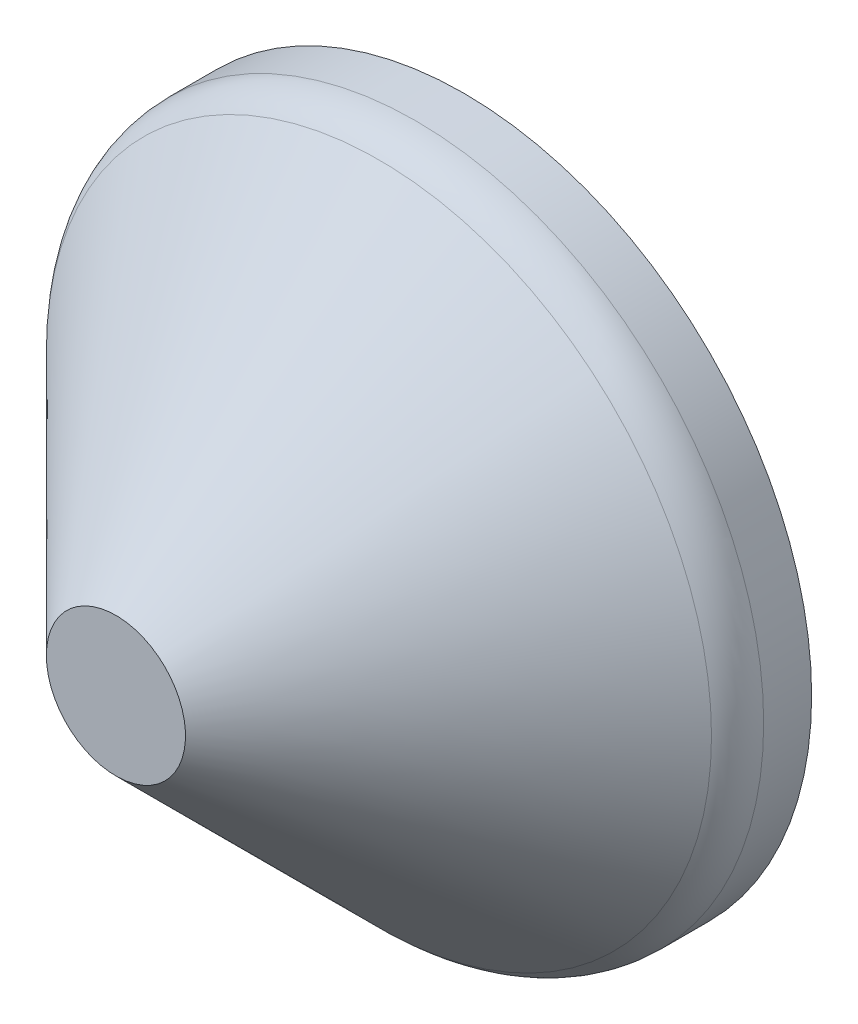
ISO-10303-21;
HEADER;
FILE_DESCRIPTION(('STEP AP214'),'2;1');
FILE_NAME('part.step','',(''),(''),'','','');
FILE_SCHEMA(('AUTOMOTIVE_DESIGN { 1 0 10303 214 1 1 1 1 }'));
ENDSEC;
DATA;
#1=APPLICATION_CONTEXT('core data for automotive mechanical design processes');
#2=APPLICATION_PROTOCOL_DEFINITION('international standard','automotive_design',2000,#1);
#3=PRODUCT_CONTEXT('',#1,'mechanical');
#4=PRODUCT('Part','Part','',(#3));
#5=PRODUCT_RELATED_PRODUCT_CATEGORY('part','',(#4));
#6=PRODUCT_DEFINITION_FORMATION('','',#4);
#7=PRODUCT_DEFINITION_CONTEXT('part definition',#1,'design');
#8=PRODUCT_DEFINITION('design','',#6,#7);
#9=PRODUCT_DEFINITION_SHAPE('','',#8);
#10=(LENGTH_UNIT() NAMED_UNIT(*) SI_UNIT(.MILLI.,.METRE.));
#11=(NAMED_UNIT(*) PLANE_ANGLE_UNIT() SI_UNIT($,.RADIAN.));
#12=(NAMED_UNIT(*) SI_UNIT($,.STERADIAN.) SOLID_ANGLE_UNIT());
#13=UNCERTAINTY_MEASURE_WITH_UNIT(LENGTH_MEASURE(1.E-05),#10,'distance_accuracy_value','');
#14=(GEOMETRIC_REPRESENTATION_CONTEXT(3) GLOBAL_UNCERTAINTY_ASSIGNED_CONTEXT((#13)) GLOBAL_UNIT_ASSIGNED_CONTEXT((#10,
#11,#12)) REPRESENTATION_CONTEXT('',''));
#15=CARTESIAN_POINT('',(0.,0.,0.));
#16=DIRECTION('',(0.,0.,1.));
#17=DIRECTION('',(1.,0.,0.));
#18=AXIS2_PLACEMENT_3D('',#15,#16,#17);
#19=CARTESIAN_POINT('',(0.,0.,0.));
#20=DIRECTION('',(0.,0.,-1.));
#21=DIRECTION('',(-1.,0.,0.));
#22=AXIS2_PLACEMENT_3D('',#19,#20,#21);
#23=PLANE('',#22);
#24=CARTESIAN_POINT('',(0.,0.,0.));
#25=DIRECTION('',(0.,0.,1.));
#26=DIRECTION('',(1.,0.,0.));
#27=AXIS2_PLACEMENT_3D('',#24,#25,#26);
#28=CIRCLE('',#27,254.);
#29=CARTESIAN_POINT('',(254.,0.,0.));
#30=VERTEX_POINT('',#29);
#31=EDGE_CURVE('E41',#30,#30,#28,.T.);
#32=ORIENTED_EDGE('',*,*,#31,.F.);
#33=EDGE_LOOP('',(#32));
#34=FACE_BOUND('',#33,.T.);
#35=CARTESIAN_POINT('',(0.,0.,0.));
#36=DIRECTION('',(0.,0.,-1.));
#37=DIRECTION('',(-1.,0.,0.));
#38=AXIS2_PLACEMENT_3D('',#35,#36,#37);
#39=CIRCLE('',#38,228.6);
#40=CARTESIAN_POINT('',(-228.6,0.,0.));
#41=VERTEX_POINT('',#40);
#42=EDGE_CURVE('E51',#41,#41,#39,.F.);
#43=ORIENTED_EDGE('',*,*,#42,.T.);
#44=EDGE_LOOP('',(#43));
#45=FACE_BOUND('',#44,.T.);
#46=ADVANCED_FACE('F30',(#34,#45),#23,.T.);
#47=CARTESIAN_POINT('',(0.,0.,254.));
#48=DIRECTION('',(0.,0.,1.));
#49=DIRECTION('',(1.,0.,0.));
#50=AXIS2_PLACEMENT_3D('',#47,#48,#49);
#51=CYLINDRICAL_SURFACE('',#50,254.);
#52=CARTESIAN_POINT('',(0.,0.,35.018463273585));
#53=DIRECTION('',(0.,0.,-1.));
#54=DIRECTION('',(-1.,0.,0.));
#55=AXIS2_PLACEMENT_3D('',#52,#53,#54);
#56=CIRCLE('',#55,254.);
#57=CARTESIAN_POINT('',(-254.,0.,35.018463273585));
#58=VERTEX_POINT('',#57);
#59=EDGE_CURVE('E10',#58,#58,#56,.T.);
#60=ORIENTED_EDGE('',*,*,#59,.T.);
#61=EDGE_LOOP('',(#60));
#62=FACE_BOUND('',#61,.T.);
#63=ORIENTED_EDGE('',*,*,#31,.T.);
#64=EDGE_LOOP('',(#63));
#65=FACE_BOUND('',#64,.T.);
#66=ADVANCED_FACE('F74',(#62,#65),#51,.T.);
#67=CARTESIAN_POINT('',(0.,0.,254.));
#68=DIRECTION('',(0.,0.,-1.));
#69=DIRECTION('',(-1.,0.,0.));
#70=AXIS2_PLACEMENT_3D('',#67,#68,#69);
#71=CONICAL_SURFACE('',#70,50.8,0.785398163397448);
#72=CARTESIAN_POINT('',(0.,0.,61.9592316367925));
#73=DIRECTION('',(0.,0.,1.));
#74=DIRECTION('',(1.,0.,0.));
#75=AXIS2_PLACEMENT_3D('',#72,#73,#74);
#76=CIRCLE('',#75,242.840768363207);
#77=CARTESIAN_POINT('',(-242.840768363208,0.,61.9592316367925));
#78=VERTEX_POINT('',#77);
#79=EDGE_CURVE('E37',#78,#78,#76,.T.);
#80=CARTESIAN_POINT('',(0.,0.,254.));
#81=DIRECTION('',(0.,0.,1.));
#82=DIRECTION('',(1.,0.,0.));
#83=AXIS2_PLACEMENT_3D('',#80,#81,#82);
#84=CIRCLE('',#83,50.8);
#85=CARTESIAN_POINT('',(-50.8,0.,254.));
#86=VERTEX_POINT('',#85);
#87=EDGE_CURVE('E45',#86,#86,#84,.T.);
#88=CARTESIAN_POINT('',(-242.840768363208,0.,61.9592316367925));
#89=CARTESIAN_POINT('',(-240.840343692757,0.,63.9596563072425));
#90=CARTESIAN_POINT('',(-238.839919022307,0.,65.9600809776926));
#91=CARTESIAN_POINT('',(-234.839069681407,0.,69.9609303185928));
#92=CARTESIAN_POINT('',(-232.838645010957,0.,71.9613549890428));
#93=CARTESIAN_POINT('',(-228.837795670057,0.,75.962204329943));
#94=CARTESIAN_POINT('',(-226.837370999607,0.,77.9626290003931));
#95=CARTESIAN_POINT('',(-222.836521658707,0.,81.9634783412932));
#96=CARTESIAN_POINT('',(-220.836096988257,0.,83.9639030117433));
#97=CARTESIAN_POINT('',(-216.835247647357,0.,87.9647523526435));
#98=CARTESIAN_POINT('',(-214.834822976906,0.,89.9651770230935));
#99=CARTESIAN_POINT('',(-210.833973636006,0.,93.9660263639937));
#100=CARTESIAN_POINT('',(-208.833548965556,0.,95.9664510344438));
#101=CARTESIAN_POINT('',(-204.832699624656,0.,99.9673003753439));
#102=CARTESIAN_POINT('',(-202.832274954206,0.,101.967725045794));
#103=CARTESIAN_POINT('',(-198.831425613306,0.,105.968574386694));
#104=CARTESIAN_POINT('',(-196.831000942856,0.,107.968999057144));
#105=CARTESIAN_POINT('',(-192.830151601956,0.,111.969848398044));
#106=CARTESIAN_POINT('',(-190.829726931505,0.,113.970273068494));
#107=CARTESIAN_POINT('',(-186.828877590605,0.,117.971122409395));
#108=CARTESIAN_POINT('',(-184.828452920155,0.,119.971547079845));
#109=CARTESIAN_POINT('',(-180.827603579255,0.,123.972396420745));
#110=CARTESIAN_POINT('',(-178.827178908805,0.,125.972821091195));
#111=CARTESIAN_POINT('',(-174.826329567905,0.,129.973670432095));
#112=CARTESIAN_POINT('',(-172.825904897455,0.,131.974095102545));
#113=CARTESIAN_POINT('',(-168.825055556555,0.,135.974944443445));
#114=CARTESIAN_POINT('',(-166.824630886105,0.,137.975369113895));
#115=CARTESIAN_POINT('',(-162.823781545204,0.,141.976218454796));
#116=CARTESIAN_POINT('',(-160.823356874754,0.,143.976643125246));
#117=CARTESIAN_POINT('',(-156.822507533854,0.,147.977492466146));
#118=CARTESIAN_POINT('',(-154.822082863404,0.,149.977917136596));
#119=CARTESIAN_POINT('',(-150.821233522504,0.,153.978766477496));
#120=CARTESIAN_POINT('',(-148.820808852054,0.,155.979191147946));
#121=CARTESIAN_POINT('',(-144.819959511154,0.,159.980040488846));
#122=CARTESIAN_POINT('',(-142.819534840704,0.,161.980465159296));
#123=CARTESIAN_POINT('',(-138.818685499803,0.,165.981314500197));
#124=CARTESIAN_POINT('',(-136.818260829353,0.,167.981739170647));
#125=CARTESIAN_POINT('',(-132.817411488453,0.,171.982588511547));
#126=CARTESIAN_POINT('',(-130.816986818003,0.,173.983013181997));
#127=CARTESIAN_POINT('',(-126.816137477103,0.,177.983862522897));
#128=CARTESIAN_POINT('',(-124.815712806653,0.,179.984287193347));
#129=CARTESIAN_POINT('',(-120.814863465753,0.,183.985136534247));
#130=CARTESIAN_POINT('',(-118.814438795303,0.,185.985561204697));
#131=CARTESIAN_POINT('',(-114.813589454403,0.,189.986410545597));
#132=CARTESIAN_POINT('',(-112.813164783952,0.,191.986835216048));
#133=CARTESIAN_POINT('',(-108.812315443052,0.,195.987684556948));
#134=CARTESIAN_POINT('',(-106.811890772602,0.,197.988109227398));
#135=CARTESIAN_POINT('',(-102.811041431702,0.,201.988958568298));
#136=CARTESIAN_POINT('',(-100.810616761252,0.,203.989383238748));
#137=CARTESIAN_POINT('',(-96.8097674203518,0.,207.990232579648));
#138=CARTESIAN_POINT('',(-94.8093427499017,0.,209.990657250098));
#139=CARTESIAN_POINT('',(-90.8084934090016,0.,213.991506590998));
#140=CARTESIAN_POINT('',(-88.8080687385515,0.,215.991931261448));
#141=CARTESIAN_POINT('',(-84.8072193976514,0.,219.992780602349));
#142=CARTESIAN_POINT('',(-82.8067947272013,0.,221.993205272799));
#143=CARTESIAN_POINT('',(-78.8059453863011,0.,225.994054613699));
#144=CARTESIAN_POINT('',(-76.805520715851,0.,227.994479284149));
#145=CARTESIAN_POINT('',(-72.8046713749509,0.,231.995328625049));
#146=CARTESIAN_POINT('',(-70.8042467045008,0.,233.995753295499));
#147=CARTESIAN_POINT('',(-66.8033973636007,0.,237.996602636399));
#148=CARTESIAN_POINT('',(-64.8029726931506,0.,239.997027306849));
#149=CARTESIAN_POINT('',(-60.8021233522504,0.,243.99787664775));
#150=CARTESIAN_POINT('',(-58.8016986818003,0.,245.9983013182));
#151=CARTESIAN_POINT('',(-54.8008493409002,0.,249.9991506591));
#152=CARTESIAN_POINT('',(-52.8004246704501,0.,251.99957532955));
#153=CARTESIAN_POINT('',(-50.8,0.,254.));
#154=B_SPLINE_CURVE_WITH_KNOTS('',3,(#88,#89,#90,#91,#92,#93,#94,#95,#96,#97,#98,#99,#100,#101,
#102,#103,#104,#105,#106,#107,#108,#109,#110,#111,#112,#113,#114,#115,#116,#117,#118,#119,#120,
#121,#122,#123,#124,#125,#126,#127,#128,#129,#130,#131,#132,#133,#134,#135,#136,#137,#138,#139,
#140,#141,#142,#143,#144,#145,#146,#147,#148,#149,#150,#151,#152,#153),.UNSPECIFIED.,.F.,.F.,(4,
2,2,2,2,2,2,2,2,2,2,2,2,2,2,2,2,2,2,2,2,2,2,2,2,2,2,2,2,2,2,2,4),(0.,8.48708309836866,
16.9741661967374,25.4612492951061,33.9483323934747,42.4354154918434,50.9224985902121,
59.4095816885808,67.8966647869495,76.3837478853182,84.8708309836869,93.3579140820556,
101.844997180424,110.332080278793,118.819163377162,127.30624647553,135.793329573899,
144.280412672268,152.767495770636,161.254578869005,169.741661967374,178.228745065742,
186.715828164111,195.20291126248,203.689994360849,212.177077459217,220.664160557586,
229.151243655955,237.638326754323,246.125409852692,254.612492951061,263.099576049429,
271.586659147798),.UNSPECIFIED.);
#155=EDGE_CURVE('BSEAM79',#78,#86,#154,.T.);
#156=ORIENTED_EDGE('',*,*,#79,.T.);
#157=ORIENTED_EDGE('',*,*,#87,.F.);
#158=ORIENTED_EDGE('',*,*,#155,.T.);
#159=ORIENTED_EDGE('',*,*,#155,.F.);
#160=EDGE_LOOP('',(#156,#158,#157,#159));
#161=FACE_BOUND('',#160,.T.);
#162=ADVANCED_FACE('F79',(#161),#71,.T.);
#163=CARTESIAN_POINT('',(50.8,0.,254.));
#164=DIRECTION('',(0.,0.,1.));
#165=DIRECTION('',(1.,0.,0.));
#166=AXIS2_PLACEMENT_3D('',#163,#164,#165);
#167=PLANE('',#166);
#168=ORIENTED_EDGE('',*,*,#87,.T.);
#169=EDGE_LOOP('',(#168));
#170=FACE_BOUND('',#169,.T.);
#171=ADVANCED_FACE('F85',(#170),#167,.T.);
#172=CARTESIAN_POINT('',(0.,0.,35.018463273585));
#173=DIRECTION('',(0.,0.,-1.));
#174=DIRECTION('',(-1.,0.,0.));
#175=AXIS2_PLACEMENT_3D('',#172,#173,#174);
#176=TOROIDAL_SURFACE('',#175,215.9,38.1);
#177=ORIENTED_EDGE('',*,*,#59,.F.);
#178=EDGE_LOOP('',(#177));
#179=FACE_BOUND('',#178,.T.);
#180=ORIENTED_EDGE('',*,*,#79,.F.);
#181=EDGE_LOOP('',(#180));
#182=FACE_BOUND('',#181,.T.);
#183=ADVANCED_FACE('F32',(#179,#182),#176,.T.);
#184=CARTESIAN_POINT('',(0.,0.,254.));
#185=DIRECTION('',(0.,0.,1.));
#186=DIRECTION('',(1.,0.,0.));
#187=AXIS2_PLACEMENT_3D('',#184,#185,#186);
#188=CYLINDRICAL_SURFACE('',#187,228.6);
#189=CARTESIAN_POINT('',(0.,0.,35.018463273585));
#190=DIRECTION('',(0.,0.,1.));
#191=DIRECTION('',(1.,0.,0.));
#192=AXIS2_PLACEMENT_3D('',#189,#190,#191);
#193=CIRCLE('',#192,228.6);
#194=CARTESIAN_POINT('',(228.6,0.,35.018463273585));
#195=VERTEX_POINT('',#194);
#196=EDGE_CURVE('E50',#195,#195,#193,.F.);
#197=ORIENTED_EDGE('',*,*,#196,.F.);
#198=EDGE_LOOP('',(#197));
#199=FACE_BOUND('',#198,.T.);
#200=ORIENTED_EDGE('',*,*,#42,.F.);
#201=EDGE_LOOP('',(#200));
#202=FACE_BOUND('',#201,.T.);
#203=ADVANCED_FACE('F66',(#199,#202),#188,.F.);
#204=CARTESIAN_POINT('',(0.,0.,236.039487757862));
#205=DIRECTION('',(0.,0.,-1.));
#206=DIRECTION('',(-1.,0.,0.));
#207=AXIS2_PLACEMENT_3D('',#204,#205,#206);
#208=CONICAL_SURFACE('',#207,32.8394877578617,0.785398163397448);
#209=CARTESIAN_POINT('',(0.,0.,43.9987193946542));
#210=DIRECTION('',(0.,0.,-1.));
#211=DIRECTION('',(-1.,0.,0.));
#212=AXIS2_PLACEMENT_3D('',#209,#210,#211);
#213=CIRCLE('',#212,224.880256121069);
#214=CARTESIAN_POINT('',(-224.880256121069,0.,43.9987193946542));
#215=VERTEX_POINT('',#214);
#216=EDGE_CURVE('E54',#215,#215,#213,.F.);
#217=CARTESIAN_POINT('',(0.,0.,228.6));
#218=DIRECTION('',(0.,0.,1.));
#219=DIRECTION('',(1.,0.,0.));
#220=AXIS2_PLACEMENT_3D('',#217,#218,#219);
#221=CIRCLE('',#220,40.2789755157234);
#222=CARTESIAN_POINT('',(-40.2789755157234,0.,228.6));
#223=VERTEX_POINT('',#222);
#224=EDGE_CURVE('E55',#223,#223,#221,.T.);
#225=CARTESIAN_POINT('',(-224.880256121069,0.,43.9987193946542));
#226=CARTESIAN_POINT('',(-222.957326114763,0.,45.9216494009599));
#227=CARTESIAN_POINT('',(-221.034396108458,0.,47.8445794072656));
#228=CARTESIAN_POINT('',(-217.188536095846,0.,51.690439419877));
#229=CARTESIAN_POINT('',(-215.265606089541,0.,53.6133694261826));
#230=CARTESIAN_POINT('',(-211.419746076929,0.,57.459229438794));
#231=CARTESIAN_POINT('',(-209.496816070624,0.,59.3821594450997));
#232=CARTESIAN_POINT('',(-205.650956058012,0.,63.2280194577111));
#233=CARTESIAN_POINT('',(-203.728026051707,0.,65.1509494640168));
#234=CARTESIAN_POINT('',(-199.882166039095,0.,68.9968094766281));
#235=CARTESIAN_POINT('',(-197.95923603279,0.,70.9197394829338));
#236=CARTESIAN_POINT('',(-194.113376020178,0.,74.7655994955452));
#237=CARTESIAN_POINT('',(-192.190446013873,0.,76.6885295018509));
#238=CARTESIAN_POINT('',(-188.344586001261,0.,80.5343895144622));
#239=CARTESIAN_POINT('',(-186.421655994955,0.,82.4573195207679));
#240=CARTESIAN_POINT('',(-182.575795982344,0.,86.3031795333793));
#241=CARTESIAN_POINT('',(-180.652865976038,0.,88.226109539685));
#242=CARTESIAN_POINT('',(-176.807005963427,0.,92.0719695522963));
#243=CARTESIAN_POINT('',(-174.884075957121,0.,93.994899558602));
#244=CARTESIAN_POINT('',(-171.03821594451,0.,97.8407595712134));
#245=CARTESIAN_POINT('',(-169.115285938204,0.,99.7636895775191));
#246=CARTESIAN_POINT('',(-165.269425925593,0.,103.60954959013));
#247=CARTESIAN_POINT('',(-163.346495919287,0.,105.532479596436));
#248=CARTESIAN_POINT('',(-159.500635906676,0.,109.378339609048));
#249=CARTESIAN_POINT('',(-157.57770590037,0.,111.301269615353));
#250=CARTESIAN_POINT('',(-153.731845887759,0.,115.147129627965));
#251=CARTESIAN_POINT('',(-151.808915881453,0.,117.07005963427));
#252=CARTESIAN_POINT('',(-147.963055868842,0.,120.915919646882));
#253=CARTESIAN_POINT('',(-146.040125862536,0.,122.838849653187));
#254=CARTESIAN_POINT('',(-142.194265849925,0.,126.684709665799));
#255=CARTESIAN_POINT('',(-140.271335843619,0.,128.607639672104));
#256=CARTESIAN_POINT('',(-136.425475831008,0.,132.453499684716));
#257=CARTESIAN_POINT('',(-134.502545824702,0.,134.376429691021));
#258=CARTESIAN_POINT('',(-130.656685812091,0.,138.222289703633));
#259=CARTESIAN_POINT('',(-128.733755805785,0.,140.145219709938));
#260=CARTESIAN_POINT('',(-124.887895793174,0.,143.99107972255));
#261=CARTESIAN_POINT('',(-122.964965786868,0.,145.914009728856));
#262=CARTESIAN_POINT('',(-119.119105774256,0.,149.759869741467));
#263=CARTESIAN_POINT('',(-117.196175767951,0.,151.682799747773));
#264=CARTESIAN_POINT('',(-113.350315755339,0.,155.528659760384));
#265=CARTESIAN_POINT('',(-111.427385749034,0.,157.45158976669));
#266=CARTESIAN_POINT('',(-107.581525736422,0.,161.297449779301));
#267=CARTESIAN_POINT('',(-105.658595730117,0.,163.220379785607));
#268=CARTESIAN_POINT('',(-101.812735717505,0.,167.066239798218));
#269=CARTESIAN_POINT('',(-99.8898057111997,0.,168.989169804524));
#270=CARTESIAN_POINT('',(-96.0439456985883,0.,172.835029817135));
#271=CARTESIAN_POINT('',(-94.1210156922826,0.,174.757959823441));
#272=CARTESIAN_POINT('',(-90.2751556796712,0.,178.603819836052));
#273=CARTESIAN_POINT('',(-88.3522256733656,0.,180.526749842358));
#274=CARTESIAN_POINT('',(-84.5063656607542,0.,184.372609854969));
#275=CARTESIAN_POINT('',(-82.5834356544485,0.,186.295539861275));
#276=CARTESIAN_POINT('',(-78.7375756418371,0.,190.141399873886));
#277=CARTESIAN_POINT('',(-76.8146456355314,0.,192.064329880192));
#278=CARTESIAN_POINT('',(-72.9687856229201,0.,195.910189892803));
#279=CARTESIAN_POINT('',(-71.0458556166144,0.,197.833119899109));
#280=CARTESIAN_POINT('',(-67.199995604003,0.,201.67897991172));
#281=CARTESIAN_POINT('',(-65.2770655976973,0.,203.601909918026));
#282=CARTESIAN_POINT('',(-61.431205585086,0.,207.447769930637));
#283=CARTESIAN_POINT('',(-59.5082755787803,0.,209.370699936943));
#284=CARTESIAN_POINT('',(-55.6624155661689,0.,213.216559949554));
#285=CARTESIAN_POINT('',(-53.7394855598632,0.,215.13948995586));
#286=CARTESIAN_POINT('',(-49.8936255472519,0.,218.985349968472));
#287=CARTESIAN_POINT('',(-47.9706955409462,0.,220.908279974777));
#288=CARTESIAN_POINT('',(-44.1248355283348,0.,224.754139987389));
#289=CARTESIAN_POINT('',(-42.2019055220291,0.,226.677069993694));
#290=CARTESIAN_POINT('',(-40.2789755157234,0.,228.6));
#291=B_SPLINE_CURVE_WITH_KNOTS('',3,(#225,#226,#227,#228,#229,#230,#231,#232,#233,#234,#235,
#236,#237,#238,#239,#240,#241,#242,#243,#244,#245,#246,#247,#248,#249,#250,#251,#252,#253,#254,
#255,#256,#257,#258,#259,#260,#261,#262,#263,#264,#265,#266,#267,#268,#269,#270,#271,#272,#273,
#274,#275,#276,#277,#278,#279,#280,#281,#282,#283,#284,#285,#286,#287,#288,#289,#290),
.UNSPECIFIED.,.F.,.F.,(4,2,2,2,2,2,2,2,2,2,2,2,2,2,2,2,2,2,2,2,2,2,2,2,2,2,2,2,2,2,2,2,4),(0.,
8.15830108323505,16.3166021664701,24.4749032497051,32.6332043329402,40.7915054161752,
48.9498064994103,57.1081075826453,65.2664086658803,73.4247097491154,81.5830108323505,
89.7413119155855,97.8996129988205,106.057914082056,114.216215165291,122.374516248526,
130.532817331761,138.691118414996,146.849419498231,155.007720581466,163.166021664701,
171.324322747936,179.482623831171,187.640924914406,195.799225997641,203.957527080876,
212.115828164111,220.274129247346,228.432430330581,236.590731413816,244.749032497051,
252.907333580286,261.065634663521),.UNSPECIFIED.);
#292=EDGE_CURVE('BSEAM69',#215,#223,#291,.T.);
#293=ORIENTED_EDGE('',*,*,#216,.F.);
#294=ORIENTED_EDGE('',*,*,#224,.T.);
#295=ORIENTED_EDGE('',*,*,#292,.T.);
#296=ORIENTED_EDGE('',*,*,#292,.F.);
#297=EDGE_LOOP('',(#293,#295,#294,#296));
#298=FACE_BOUND('',#297,.T.);
#299=ADVANCED_FACE('F69',(#298),#208,.F.);
#300=CARTESIAN_POINT('',(50.8,0.,228.6));
#301=DIRECTION('',(0.,0.,1.));
#302=DIRECTION('',(1.,0.,0.));
#303=AXIS2_PLACEMENT_3D('',#300,#301,#302);
#304=PLANE('',#303);
#305=ORIENTED_EDGE('',*,*,#224,.F.);
#306=EDGE_LOOP('',(#305));
#307=FACE_BOUND('',#306,.T.);
#308=ADVANCED_FACE('F91',(#307),#304,.F.);
#309=CARTESIAN_POINT('',(0.,0.,35.018463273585));
#310=DIRECTION('',(0.,0.,-1.));
#311=DIRECTION('',(-1.,0.,0.));
#312=AXIS2_PLACEMENT_3D('',#309,#310,#311);
#313=TOROIDAL_SURFACE('',#312,215.9,12.7);
#314=ORIENTED_EDGE('',*,*,#196,.T.);
#315=EDGE_LOOP('',(#314));
#316=FACE_BOUND('',#315,.T.);
#317=ORIENTED_EDGE('',*,*,#216,.T.);
#318=EDGE_LOOP('',(#317));
#319=FACE_BOUND('',#318,.T.);
#320=ADVANCED_FACE('F63',(#316,#319),#313,.F.);
#321=CLOSED_SHELL('',(#46,#66,#162,#171,#183,#203,#299,#308,#320));
#322=MANIFOLD_SOLID_BREP('B2',#321);
#323=ADVANCED_BREP_SHAPE_REPRESENTATION('',(#18,#322),#14);
#324=SHAPE_DEFINITION_REPRESENTATION(#9,#323);
ENDSEC;
END-ISO-10303-21;
